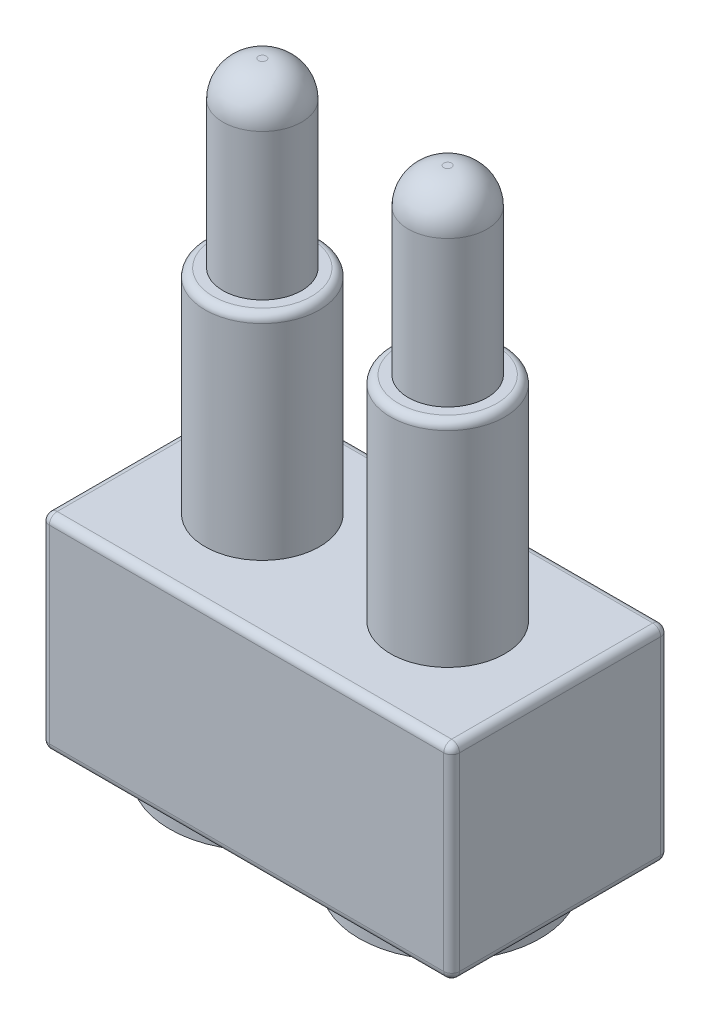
from build123d import *

# Parameters (mm, degrees)
SKETCH_1_W      = 5.2
SKETCH_1_H      = 2.75
EXTRUDE_1_DEPTH = 2.6
SKETCH_2_R      = 1.15
EXTRUDE_2_DEPTH = 0.3
SKETCH_3_R      = 0.725
EXTRUDE_3_DEPTH = 2.7
SKETCH_4_R      = 0.5
EXTRUDE_4_DEPTH = 2.3
FILLET_1_R      = 0.45
FILLET_2_R      = 0.1
FILLET_3_R      = 0.1


with BuildPart() as part:
    # Sketch 1 → Extrude 1 (new body)
    with BuildSketch(Plane(origin=(0, 0, 0), x_dir=(1, 0, 0), z_dir=(0, 1, 0))):
        Rectangle(SKETCH_1_W, SKETCH_1_H)
    extrude(amount=EXTRUDE_1_DEPTH)

    # Sketch 2 → Extrude 2 (add)
    with BuildSketch(Plane.XZ):
        with Locations(Location((-1.2, 0, 0), (0, 0, 90))):
            Circle(SKETCH_2_R)
        with Locations(Location((1.2, 0, 0), (0, 0, 90))):
            Circle(SKETCH_2_R)
    extrude(amount=EXTRUDE_2_DEPTH)

    # Sketch 3 → Extrude 3 (add)
    with BuildSketch(Plane(origin=(0, 2.6, 0), x_dir=(1, 0, 0), z_dir=(0, 1, 0))):
        with Locations(Location((-1.175, 0, 0), (0, 0, 90))):
            Circle(SKETCH_3_R)
        with Locations(Location((1.175, 0, 0), (0, 0, 90))):
            Circle(SKETCH_3_R)
    extrude(amount=EXTRUDE_3_DEPTH)

    # Sketch 4 → Extrude 4 (add)
    with BuildSketch(Plane(origin=(0, 5.3, 0), x_dir=(1, 0, 0), z_dir=(0, 1, 0))):
        with Locations(Location((-1.175, 0, 0), (0, 0, 270))):
            Circle(SKETCH_4_R)
        with Locations(Location((1.175, 0, 0), (0, 0, 270))):
            Circle(SKETCH_4_R)
    extrude(amount=EXTRUDE_4_DEPTH)

    # Fillet 1
    fillet_1_edges = [part.edges().sort_by_distance(p)[0] for p in [
        (-1.175, 7.6, -0.5),
        (1.175, 7.6, -0.5),
    ]]
    fillet(fillet_1_edges, radius=FILLET_1_R)

    # Fillet 2
    fillet_2_edges = [part.edges().sort_by_distance(p)[0] for p in [
        (-1.175, 5.3, 0.725),
        (1.175, 5.3, 0.725),
    ]]
    fillet(fillet_2_edges, radius=FILLET_2_R)

    # Fillet 3
    fillet_3_edges = [part.edges().sort_by_distance(p)[0] for p in [
        (-2.6, 2.6, 0),
        (0, 2.6, 1.375),
        (2.6, 2.6, 0),
        (0, 0, 1.375),
        (-2.6, 0, 0),
        (0, 0, -1.375),
        (2.6, 0, 0),
        (2.6, 1.3, 1.375),
        (-2.6, 1.3, 1.375),
        (-2.6, 1.3, -1.375),
        (2.6, 1.3, -1.375),
        (0, 2.6, -1.375),
    ]]
    fillet(fillet_3_edges, radius=FILLET_3_R)


solid = part.part
